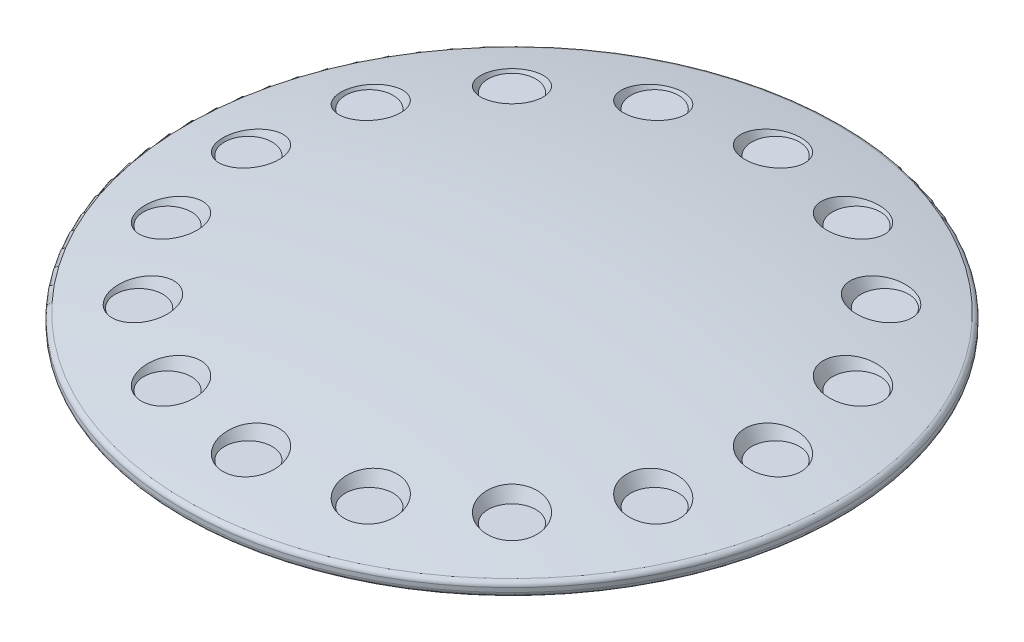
from build123d import *

# Parameters (mm, degrees)
ESQUISSE3_R                        = 7
ENL_V_MAT_EXTRU_1_DEPTH            = 4
ENL_V_MAT_EXTRU_1_DRAFT            = -30
ENL_V_MAT_EXTRU_1_PROFILE_2_DEPTH  = 4
ENL_V_MAT_EXTRU_1_PROFILE_2_DRAFT  = -30
ENL_V_MAT_EXTRU_1_PROFILE_3_DEPTH  = 4
ENL_V_MAT_EXTRU_1_PROFILE_3_DRAFT  = -30
ENL_V_MAT_EXTRU_1_PROFILE_4_DEPTH  = 4
ENL_V_MAT_EXTRU_1_PROFILE_4_DRAFT  = -30
ENL_V_MAT_EXTRU_1_PROFILE_5_DEPTH  = 4
ENL_V_MAT_EXTRU_1_PROFILE_5_DRAFT  = -30
ENL_V_MAT_EXTRU_1_PROFILE_6_DEPTH  = 4
ENL_V_MAT_EXTRU_1_PROFILE_6_DRAFT  = -30
ENL_V_MAT_EXTRU_1_PROFILE_7_DEPTH  = 4
ENL_V_MAT_EXTRU_1_PROFILE_7_DRAFT  = -30
ENL_V_MAT_EXTRU_1_PROFILE_8_DEPTH  = 4
ENL_V_MAT_EXTRU_1_PROFILE_8_DRAFT  = -30
ENL_V_MAT_EXTRU_1_PROFILE_9_DEPTH  = 4
ENL_V_MAT_EXTRU_1_PROFILE_9_DRAFT  = -30
ENL_V_MAT_EXTRU_1_PROFILE_10_DEPTH = 4
ENL_V_MAT_EXTRU_1_PROFILE_10_DRAFT = -30
ENL_V_MAT_EXTRU_1_PROFILE_11_DEPTH = 4
ENL_V_MAT_EXTRU_1_PROFILE_11_DRAFT = -30
ENL_V_MAT_EXTRU_1_PROFILE_12_DEPTH = 4
ENL_V_MAT_EXTRU_1_PROFILE_12_DRAFT = -30
ENL_V_MAT_EXTRU_1_PROFILE_13_DEPTH = 4
ENL_V_MAT_EXTRU_1_PROFILE_13_DRAFT = -30
ENL_V_MAT_EXTRU_1_PROFILE_14_DEPTH = 4
ENL_V_MAT_EXTRU_1_PROFILE_14_DRAFT = -30
ENL_V_MAT_EXTRU_1_PROFILE_15_DEPTH = 4
ENL_V_MAT_EXTRU_1_PROFILE_15_DRAFT = -30
ENL_V_MAT_EXTRU_1_PROFILE_16_DEPTH = 4
ENL_V_MAT_EXTRU_1_PROFILE_16_DRAFT = -30
ESQUISSE4_R                        = 1.25
ENL_V_MAT_EXTRU_2_DEPTH            = 1


with BuildPart() as part:
    # Esquisse2 → R_volution1 (revolve)
    with BuildSketch(Plane.XY, mode=Mode.PRIVATE) as r_volution1_sk:
        with BuildLine():
            Line((64.348533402, -2.586899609), (0, -2.586899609))
            Line((0, -2.586899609), (0, 6.737774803))
            ThreePointArc((0, 6.737774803), (32.269029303, 5.090560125), (64.202595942, 0.166040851))
            ThreePointArc((64.202595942, 0.166040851), (64.775434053, -0.181793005), (65, -0.813221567))
            Line((65, -0.813221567), (65, -1.649603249))
            ThreePointArc((65, -1.649603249), (64.821137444, -2.220333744), (64.348533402, -2.586899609))
        make_face()
    revolve(r_volution1_sk.sketch.rotate(Axis((0, 0, 0), (0, 1, 0)), 90), axis=Axis((0, 0, 0), (0, 1, 0)))


with BuildPart() as enl_v_mat_extru_1_tool:
    # Esquisse3 → Enl_v. mat.-Extru.1 (with draft: the straight prism first)
    with BuildSketch(Plane(origin=(0, 5, 0), x_dir=(1, 0, 0), z_dir=(0, 1, 0))):
        with Locations((0, 52)):
            Circle(ESQUISSE3_R)
    extrude(amount=-ENL_V_MAT_EXTRU_1_DEPTH)
    # Enl_v. mat.-Extru.1: the draft: its side faces are tilted about the plane it starts from
    enl_v_mat_extru_1_sides = [enl_v_mat_extru_1_tool.faces().sort_by_distance(p)[0] for p in [
        (-7, 3, -52),
    ]]
    draft(enl_v_mat_extru_1_sides, Plane(origin=(0, 5, 0), x_dir=(1, 0, 0), z_dir=(0, 1, 0)), ENL_V_MAT_EXTRU_1_DRAFT)


with BuildPart() as part_1:
    add(part.part)

    # Enl_v. mat.-Extru.1: cut by enl_v_mat_extru_1_tool
    add(enl_v_mat_extru_1_tool.part, mode=Mode.SUBTRACT)


with BuildPart() as enl_v_mat_extru_1_profile_2_tool:
    # Esquisse3 → Enl_v. mat.-Extru.1 profile 2 (with draft: the straight prism first)
    with BuildSketch(Plane(origin=(0, 5, 0), x_dir=(1, 0, 0), z_dir=(0, 1, 0))):
        with Locations((19.899538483, 48.041735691)):
            Circle(ESQUISSE3_R)
    extrude(amount=-ENL_V_MAT_EXTRU_1_PROFILE_2_DEPTH)
    # Enl_v. mat.-Extru.1 profile 2: the draft: its side faces are tilted about the plane it starts from
    enl_v_mat_extru_1_profile_2_sides = [enl_v_mat_extru_1_profile_2_tool.faces().sort_by_distance(p)[0] for p in [
        (12.899538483, 3, -48.041735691),
    ]]
    draft(enl_v_mat_extru_1_profile_2_sides, Plane(origin=(0, 5, 0), x_dir=(1, 0, 0), z_dir=(0, 1, 0)), ENL_V_MAT_EXTRU_1_PROFILE_2_DRAFT)


with BuildPart() as part_2:
    add(part_1.part)

    # Enl_v. mat.-Extru.1 profile 2: cut by enl_v_mat_extru_1_profile_2_tool
    add(enl_v_mat_extru_1_profile_2_tool.part, mode=Mode.SUBTRACT)


with BuildPart() as enl_v_mat_extru_1_profile_3_tool:
    # Esquisse3 → Enl_v. mat.-Extru.1 profile 3 (with draft: the straight prism first)
    with BuildSketch(Plane(origin=(0, 5, 0), x_dir=(1, 0, 0), z_dir=(0, 1, 0))):
        with Locations((36.769552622, 36.769552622)):
            Circle(ESQUISSE3_R)
    extrude(amount=-ENL_V_MAT_EXTRU_1_PROFILE_3_DEPTH)
    # Enl_v. mat.-Extru.1 profile 3: the draft: its side faces are tilted about the plane it starts from
    enl_v_mat_extru_1_profile_3_sides = [enl_v_mat_extru_1_profile_3_tool.faces().sort_by_distance(p)[0] for p in [
        (29.769552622, 3, -36.769552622),
    ]]
    draft(enl_v_mat_extru_1_profile_3_sides, Plane(origin=(0, 5, 0), x_dir=(1, 0, 0), z_dir=(0, 1, 0)), ENL_V_MAT_EXTRU_1_PROFILE_3_DRAFT)


with BuildPart() as part_3:
    add(part_2.part)

    # Enl_v. mat.-Extru.1 profile 3: cut by enl_v_mat_extru_1_profile_3_tool
    add(enl_v_mat_extru_1_profile_3_tool.part, mode=Mode.SUBTRACT)


with BuildPart() as enl_v_mat_extru_1_profile_4_tool:
    # Esquisse3 → Enl_v. mat.-Extru.1 profile 4 (with draft: the straight prism first)
    with BuildSketch(Plane(origin=(0, 5, 0), x_dir=(1, 0, 0), z_dir=(0, 1, 0))):
        with Locations((48.041735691, 19.899538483)):
            Circle(ESQUISSE3_R)
    extrude(amount=-ENL_V_MAT_EXTRU_1_PROFILE_4_DEPTH)
    # Enl_v. mat.-Extru.1 profile 4: the draft: its side faces are tilted about the plane it starts from
    enl_v_mat_extru_1_profile_4_sides = [enl_v_mat_extru_1_profile_4_tool.faces().sort_by_distance(p)[0] for p in [
        (41.041735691, 3, -19.899538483),
    ]]
    draft(enl_v_mat_extru_1_profile_4_sides, Plane(origin=(0, 5, 0), x_dir=(1, 0, 0), z_dir=(0, 1, 0)), ENL_V_MAT_EXTRU_1_PROFILE_4_DRAFT)


with BuildPart() as part_4:
    add(part_3.part)

    # Enl_v. mat.-Extru.1 profile 4: cut by enl_v_mat_extru_1_profile_4_tool
    add(enl_v_mat_extru_1_profile_4_tool.part, mode=Mode.SUBTRACT)


with BuildPart() as enl_v_mat_extru_1_profile_5_tool:
    # Esquisse3 → Enl_v. mat.-Extru.1 profile 5 (with draft: the straight prism first)
    with BuildSketch(Plane(origin=(0, 5, 0), x_dir=(1, 0, 0), z_dir=(0, 1, 0))):
        with Locations((52, 0)):
            Circle(ESQUISSE3_R)
    extrude(amount=-ENL_V_MAT_EXTRU_1_PROFILE_5_DEPTH)
    # Enl_v. mat.-Extru.1 profile 5: the draft: its side faces are tilted about the plane it starts from
    enl_v_mat_extru_1_profile_5_sides = [enl_v_mat_extru_1_profile_5_tool.faces().sort_by_distance(p)[0] for p in [
        (45, 3, 0),
    ]]
    draft(enl_v_mat_extru_1_profile_5_sides, Plane(origin=(0, 5, 0), x_dir=(1, 0, 0), z_dir=(0, 1, 0)), ENL_V_MAT_EXTRU_1_PROFILE_5_DRAFT)


with BuildPart() as part_5:
    add(part_4.part)

    # Enl_v. mat.-Extru.1 profile 5: cut by enl_v_mat_extru_1_profile_5_tool
    add(enl_v_mat_extru_1_profile_5_tool.part, mode=Mode.SUBTRACT)


with BuildPart() as enl_v_mat_extru_1_profile_6_tool:
    # Esquisse3 → Enl_v. mat.-Extru.1 profile 6 (with draft: the straight prism first)
    with BuildSketch(Plane(origin=(0, 5, 0), x_dir=(1, 0, 0), z_dir=(0, 1, 0))):
        with Locations((48.041735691, -19.899538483)):
            Circle(ESQUISSE3_R)
    extrude(amount=-ENL_V_MAT_EXTRU_1_PROFILE_6_DEPTH)
    # Enl_v. mat.-Extru.1 profile 6: the draft: its side faces are tilted about the plane it starts from
    enl_v_mat_extru_1_profile_6_sides = [enl_v_mat_extru_1_profile_6_tool.faces().sort_by_distance(p)[0] for p in [
        (41.041735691, 3, 19.899538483),
    ]]
    draft(enl_v_mat_extru_1_profile_6_sides, Plane(origin=(0, 5, 0), x_dir=(1, 0, 0), z_dir=(0, 1, 0)), ENL_V_MAT_EXTRU_1_PROFILE_6_DRAFT)


with BuildPart() as part_6:
    add(part_5.part)

    # Enl_v. mat.-Extru.1 profile 6: cut by enl_v_mat_extru_1_profile_6_tool
    add(enl_v_mat_extru_1_profile_6_tool.part, mode=Mode.SUBTRACT)


with BuildPart() as enl_v_mat_extru_1_profile_7_tool:
    # Esquisse3 → Enl_v. mat.-Extru.1 profile 7 (with draft: the straight prism first)
    with BuildSketch(Plane(origin=(0, 5, 0), x_dir=(1, 0, 0), z_dir=(0, 1, 0))):
        with Locations((36.769552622, -36.769552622)):
            Circle(ESQUISSE3_R)
    extrude(amount=-ENL_V_MAT_EXTRU_1_PROFILE_7_DEPTH)
    # Enl_v. mat.-Extru.1 profile 7: the draft: its side faces are tilted about the plane it starts from
    enl_v_mat_extru_1_profile_7_sides = [enl_v_mat_extru_1_profile_7_tool.faces().sort_by_distance(p)[0] for p in [
        (29.769552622, 3, 36.769552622),
    ]]
    draft(enl_v_mat_extru_1_profile_7_sides, Plane(origin=(0, 5, 0), x_dir=(1, 0, 0), z_dir=(0, 1, 0)), ENL_V_MAT_EXTRU_1_PROFILE_7_DRAFT)


with BuildPart() as part_7:
    add(part_6.part)

    # Enl_v. mat.-Extru.1 profile 7: cut by enl_v_mat_extru_1_profile_7_tool
    add(enl_v_mat_extru_1_profile_7_tool.part, mode=Mode.SUBTRACT)


with BuildPart() as enl_v_mat_extru_1_profile_8_tool:
    # Esquisse3 → Enl_v. mat.-Extru.1 profile 8 (with draft: the straight prism first)
    with BuildSketch(Plane(origin=(0, 5, 0), x_dir=(1, 0, 0), z_dir=(0, 1, 0))):
        with Locations((19.899538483, -48.041735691)):
            Circle(ESQUISSE3_R)
    extrude(amount=-ENL_V_MAT_EXTRU_1_PROFILE_8_DEPTH)
    # Enl_v. mat.-Extru.1 profile 8: the draft: its side faces are tilted about the plane it starts from
    enl_v_mat_extru_1_profile_8_sides = [enl_v_mat_extru_1_profile_8_tool.faces().sort_by_distance(p)[0] for p in [
        (12.899538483, 3, 48.041735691),
    ]]
    draft(enl_v_mat_extru_1_profile_8_sides, Plane(origin=(0, 5, 0), x_dir=(1, 0, 0), z_dir=(0, 1, 0)), ENL_V_MAT_EXTRU_1_PROFILE_8_DRAFT)


with BuildPart() as part_8:
    add(part_7.part)

    # Enl_v. mat.-Extru.1 profile 8: cut by enl_v_mat_extru_1_profile_8_tool
    add(enl_v_mat_extru_1_profile_8_tool.part, mode=Mode.SUBTRACT)


with BuildPart() as enl_v_mat_extru_1_profile_9_tool:
    # Esquisse3 → Enl_v. mat.-Extru.1 profile 9 (with draft: the straight prism first)
    with BuildSketch(Plane(origin=(0, 5, 0), x_dir=(1, 0, 0), z_dir=(0, 1, 0))):
        with Locations((0, -52)):
            Circle(ESQUISSE3_R)
    extrude(amount=-ENL_V_MAT_EXTRU_1_PROFILE_9_DEPTH)
    # Enl_v. mat.-Extru.1 profile 9: the draft: its side faces are tilted about the plane it starts from
    enl_v_mat_extru_1_profile_9_sides = [enl_v_mat_extru_1_profile_9_tool.faces().sort_by_distance(p)[0] for p in [
        (-7, 3, 52),
    ]]
    draft(enl_v_mat_extru_1_profile_9_sides, Plane(origin=(0, 5, 0), x_dir=(1, 0, 0), z_dir=(0, 1, 0)), ENL_V_MAT_EXTRU_1_PROFILE_9_DRAFT)


with BuildPart() as part_9:
    add(part_8.part)

    # Enl_v. mat.-Extru.1 profile 9: cut by enl_v_mat_extru_1_profile_9_tool
    add(enl_v_mat_extru_1_profile_9_tool.part, mode=Mode.SUBTRACT)


with BuildPart() as enl_v_mat_extru_1_profile_10_tool:
    # Esquisse3 → Enl_v. mat.-Extru.1 profile 10 (with draft: the straight prism first)
    with BuildSketch(Plane(origin=(0, 5, 0), x_dir=(1, 0, 0), z_dir=(0, 1, 0))):
        with Locations((-19.899538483, -48.041735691)):
            Circle(ESQUISSE3_R)
    extrude(amount=-ENL_V_MAT_EXTRU_1_PROFILE_10_DEPTH)
    # Enl_v. mat.-Extru.1 profile 10: the draft: its side faces are tilted about the plane it starts from
    enl_v_mat_extru_1_profile_10_sides = [enl_v_mat_extru_1_profile_10_tool.faces().sort_by_distance(p)[0] for p in [
        (-26.899538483, 3, 48.041735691),
    ]]
    draft(enl_v_mat_extru_1_profile_10_sides, Plane(origin=(0, 5, 0), x_dir=(1, 0, 0), z_dir=(0, 1, 0)), ENL_V_MAT_EXTRU_1_PROFILE_10_DRAFT)


with BuildPart() as part_10:
    add(part_9.part)

    # Enl_v. mat.-Extru.1 profile 10: cut by enl_v_mat_extru_1_profile_10_tool
    add(enl_v_mat_extru_1_profile_10_tool.part, mode=Mode.SUBTRACT)


with BuildPart() as enl_v_mat_extru_1_profile_11_tool:
    # Esquisse3 → Enl_v. mat.-Extru.1 profile 11 (with draft: the straight prism first)
    with BuildSketch(Plane(origin=(0, 5, 0), x_dir=(1, 0, 0), z_dir=(0, 1, 0))):
        with Locations((-36.769552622, -36.769552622)):
            Circle(ESQUISSE3_R)
    extrude(amount=-ENL_V_MAT_EXTRU_1_PROFILE_11_DEPTH)
    # Enl_v. mat.-Extru.1 profile 11: the draft: its side faces are tilted about the plane it starts from
    enl_v_mat_extru_1_profile_11_sides = [enl_v_mat_extru_1_profile_11_tool.faces().sort_by_distance(p)[0] for p in [
        (-43.769552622, 3, 36.769552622),
    ]]
    draft(enl_v_mat_extru_1_profile_11_sides, Plane(origin=(0, 5, 0), x_dir=(1, 0, 0), z_dir=(0, 1, 0)), ENL_V_MAT_EXTRU_1_PROFILE_11_DRAFT)


with BuildPart() as part_11:
    add(part_10.part)

    # Enl_v. mat.-Extru.1 profile 11: cut by enl_v_mat_extru_1_profile_11_tool
    add(enl_v_mat_extru_1_profile_11_tool.part, mode=Mode.SUBTRACT)


with BuildPart() as enl_v_mat_extru_1_profile_12_tool:
    # Esquisse3 → Enl_v. mat.-Extru.1 profile 12 (with draft: the straight prism first)
    with BuildSketch(Plane(origin=(0, 5, 0), x_dir=(1, 0, 0), z_dir=(0, 1, 0))):
        with Locations((-48.041735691, -19.899538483)):
            Circle(ESQUISSE3_R)
    extrude(amount=-ENL_V_MAT_EXTRU_1_PROFILE_12_DEPTH)
    # Enl_v. mat.-Extru.1 profile 12: the draft: its side faces are tilted about the plane it starts from
    enl_v_mat_extru_1_profile_12_sides = [enl_v_mat_extru_1_profile_12_tool.faces().sort_by_distance(p)[0] for p in [
        (-55.041735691, 3, 19.899538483),
    ]]
    draft(enl_v_mat_extru_1_profile_12_sides, Plane(origin=(0, 5, 0), x_dir=(1, 0, 0), z_dir=(0, 1, 0)), ENL_V_MAT_EXTRU_1_PROFILE_12_DRAFT)


with BuildPart() as part_12:
    add(part_11.part)

    # Enl_v. mat.-Extru.1 profile 12: cut by enl_v_mat_extru_1_profile_12_tool
    add(enl_v_mat_extru_1_profile_12_tool.part, mode=Mode.SUBTRACT)


with BuildPart() as enl_v_mat_extru_1_profile_13_tool:
    # Esquisse3 → Enl_v. mat.-Extru.1 profile 13 (with draft: the straight prism first)
    with BuildSketch(Plane(origin=(0, 5, 0), x_dir=(1, 0, 0), z_dir=(0, 1, 0))):
        with Locations((-52, 0)):
            Circle(ESQUISSE3_R)
    extrude(amount=-ENL_V_MAT_EXTRU_1_PROFILE_13_DEPTH)
    # Enl_v. mat.-Extru.1 profile 13: the draft: its side faces are tilted about the plane it starts from
    enl_v_mat_extru_1_profile_13_sides = [enl_v_mat_extru_1_profile_13_tool.faces().sort_by_distance(p)[0] for p in [
        (-59, 3, 0),
    ]]
    draft(enl_v_mat_extru_1_profile_13_sides, Plane(origin=(0, 5, 0), x_dir=(1, 0, 0), z_dir=(0, 1, 0)), ENL_V_MAT_EXTRU_1_PROFILE_13_DRAFT)


with BuildPart() as part_13:
    add(part_12.part)

    # Enl_v. mat.-Extru.1 profile 13: cut by enl_v_mat_extru_1_profile_13_tool
    add(enl_v_mat_extru_1_profile_13_tool.part, mode=Mode.SUBTRACT)


with BuildPart() as enl_v_mat_extru_1_profile_14_tool:
    # Esquisse3 → Enl_v. mat.-Extru.1 profile 14 (with draft: the straight prism first)
    with BuildSketch(Plane(origin=(0, 5, 0), x_dir=(1, 0, 0), z_dir=(0, 1, 0))):
        with Locations((-48.041735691, 19.899538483)):
            Circle(ESQUISSE3_R)
    extrude(amount=-ENL_V_MAT_EXTRU_1_PROFILE_14_DEPTH)
    # Enl_v. mat.-Extru.1 profile 14: the draft: its side faces are tilted about the plane it starts from
    enl_v_mat_extru_1_profile_14_sides = [enl_v_mat_extru_1_profile_14_tool.faces().sort_by_distance(p)[0] for p in [
        (-55.041735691, 3, -19.899538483),
    ]]
    draft(enl_v_mat_extru_1_profile_14_sides, Plane(origin=(0, 5, 0), x_dir=(1, 0, 0), z_dir=(0, 1, 0)), ENL_V_MAT_EXTRU_1_PROFILE_14_DRAFT)


with BuildPart() as part_14:
    add(part_13.part)

    # Enl_v. mat.-Extru.1 profile 14: cut by enl_v_mat_extru_1_profile_14_tool
    add(enl_v_mat_extru_1_profile_14_tool.part, mode=Mode.SUBTRACT)


with BuildPart() as enl_v_mat_extru_1_profile_15_tool:
    # Esquisse3 → Enl_v. mat.-Extru.1 profile 15 (with draft: the straight prism first)
    with BuildSketch(Plane(origin=(0, 5, 0), x_dir=(1, 0, 0), z_dir=(0, 1, 0))):
        with Locations((-36.769552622, 36.769552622)):
            Circle(ESQUISSE3_R)
    extrude(amount=-ENL_V_MAT_EXTRU_1_PROFILE_15_DEPTH)
    # Enl_v. mat.-Extru.1 profile 15: the draft: its side faces are tilted about the plane it starts from
    enl_v_mat_extru_1_profile_15_sides = [enl_v_mat_extru_1_profile_15_tool.faces().sort_by_distance(p)[0] for p in [
        (-43.769552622, 3, -36.769552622),
    ]]
    draft(enl_v_mat_extru_1_profile_15_sides, Plane(origin=(0, 5, 0), x_dir=(1, 0, 0), z_dir=(0, 1, 0)), ENL_V_MAT_EXTRU_1_PROFILE_15_DRAFT)


with BuildPart() as part_15:
    add(part_14.part)

    # Enl_v. mat.-Extru.1 profile 15: cut by enl_v_mat_extru_1_profile_15_tool
    add(enl_v_mat_extru_1_profile_15_tool.part, mode=Mode.SUBTRACT)


with BuildPart() as enl_v_mat_extru_1_profile_16_tool:
    # Esquisse3 → Enl_v. mat.-Extru.1 profile 16 (with draft: the straight prism first)
    with BuildSketch(Plane(origin=(0, 5, 0), x_dir=(1, 0, 0), z_dir=(0, 1, 0))):
        with Locations((-19.899538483, 48.041735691)):
            Circle(ESQUISSE3_R)
    extrude(amount=-ENL_V_MAT_EXTRU_1_PROFILE_16_DEPTH)
    # Enl_v. mat.-Extru.1 profile 16: the draft: its side faces are tilted about the plane it starts from
    enl_v_mat_extru_1_profile_16_sides = [enl_v_mat_extru_1_profile_16_tool.faces().sort_by_distance(p)[0] for p in [
        (-26.899538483, 3, -48.041735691),
    ]]
    draft(enl_v_mat_extru_1_profile_16_sides, Plane(origin=(0, 5, 0), x_dir=(1, 0, 0), z_dir=(0, 1, 0)), ENL_V_MAT_EXTRU_1_PROFILE_16_DRAFT)


with BuildPart() as part_16:
    add(part_15.part)

    # Enl_v. mat.-Extru.1 profile 16: cut by enl_v_mat_extru_1_profile_16_tool
    add(enl_v_mat_extru_1_profile_16_tool.part, mode=Mode.SUBTRACT)

    # Esquisse4 → Enl_v. mat.-Extru.2 (cut)
    with BuildSketch(Plane.XZ.offset(2.586899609)):
        with Locations(Location((62, 0, 0), (0, 0, 270))):
            Circle(ESQUISSE4_R)
    extrude(amount=-ENL_V_MAT_EXTRU_2_DEPTH, mode=Mode.SUBTRACT)


solid = part_16.part
